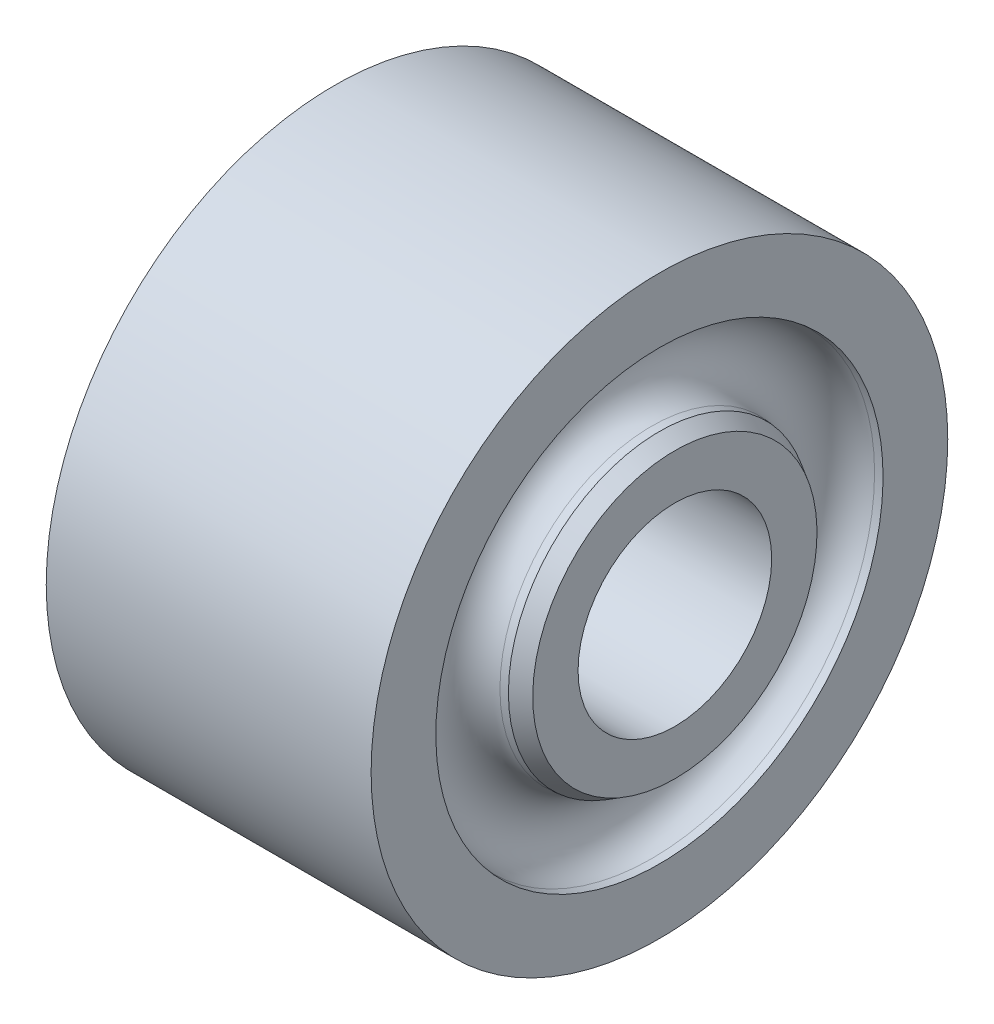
ISO-10303-21;
HEADER;
FILE_DESCRIPTION(('STEP AP214'),'2;1');
FILE_NAME('part.step','',(''),(''),'','','');
FILE_SCHEMA(('AUTOMOTIVE_DESIGN { 1 0 10303 214 1 1 1 1 }'));
ENDSEC;
DATA;
#1=APPLICATION_CONTEXT('core data for automotive mechanical design processes');
#2=APPLICATION_PROTOCOL_DEFINITION('international standard','automotive_design',2000,#1);
#3=PRODUCT_CONTEXT('',#1,'mechanical');
#4=PRODUCT('Part','Part','',(#3));
#5=PRODUCT_RELATED_PRODUCT_CATEGORY('part','',(#4));
#6=PRODUCT_DEFINITION_FORMATION('','',#4);
#7=PRODUCT_DEFINITION_CONTEXT('part definition',#1,'design');
#8=PRODUCT_DEFINITION('design','',#6,#7);
#9=PRODUCT_DEFINITION_SHAPE('','',#8);
#10=(LENGTH_UNIT() NAMED_UNIT(*) SI_UNIT(.MILLI.,.METRE.));
#11=(NAMED_UNIT(*) PLANE_ANGLE_UNIT() SI_UNIT($,.RADIAN.));
#12=(NAMED_UNIT(*) SI_UNIT($,.STERADIAN.) SOLID_ANGLE_UNIT());
#13=UNCERTAINTY_MEASURE_WITH_UNIT(LENGTH_MEASURE(1.E-05),#10,'distance_accuracy_value','');
#14=(GEOMETRIC_REPRESENTATION_CONTEXT(3) GLOBAL_UNCERTAINTY_ASSIGNED_CONTEXT((#13)) GLOBAL_UNIT_ASSIGNED_CONTEXT((#10,
#11,#12)) REPRESENTATION_CONTEXT('',''));
#15=CARTESIAN_POINT('',(0.,0.,0.));
#16=DIRECTION('',(0.,0.,1.));
#17=DIRECTION('',(1.,0.,0.));
#18=AXIS2_PLACEMENT_3D('',#15,#16,#17);
#19=CARTESIAN_POINT('',(-76.6240063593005,0.,0.));
#20=DIRECTION('',(-1.,0.,0.));
#21=DIRECTION('',(0.,0.,1.));
#22=AXIS2_PLACEMENT_3D('',#19,#20,#21);
#23=CYLINDRICAL_SURFACE('',#22,15.1384);
#24=CARTESIAN_POINT('',(-27.813,0.,0.));
#25=DIRECTION('',(-1.,0.,0.));
#26=DIRECTION('',(0.,0.,1.));
#27=AXIS2_PLACEMENT_3D('',#24,#25,#26);
#28=CIRCLE('',#27,15.1384);
#29=CARTESIAN_POINT('',(-27.813,0.,15.1384));
#30=VERTEX_POINT('',#29);
#31=EDGE_CURVE('E46',#30,#30,#28,.T.);
#32=ORIENTED_EDGE('',*,*,#31,.T.);
#33=EDGE_LOOP('',(#32));
#34=FACE_BOUND('',#33,.T.);
#35=CARTESIAN_POINT('',(27.813,0.,0.));
#36=DIRECTION('',(-1.,0.,0.));
#37=DIRECTION('',(0.,0.,1.));
#38=AXIS2_PLACEMENT_3D('',#35,#36,#37);
#39=CIRCLE('',#38,15.1384);
#40=CARTESIAN_POINT('',(27.813,0.,15.1384));
#41=VERTEX_POINT('',#40);
#42=EDGE_CURVE('E17',#41,#41,#39,.F.);
#43=ORIENTED_EDGE('',*,*,#42,.T.);
#44=EDGE_LOOP('',(#43));
#45=FACE_BOUND('',#44,.T.);
#46=ADVANCED_FACE('F14',(#34,#45),#23,.F.);
#47=CARTESIAN_POINT('',(27.813,15.1384,0.));
#48=DIRECTION('',(-1.,0.,0.));
#49=DIRECTION('',(0.,0.,1.));
#50=AXIS2_PLACEMENT_3D('',#47,#48,#49);
#51=PLANE('',#50);
#52=ORIENTED_EDGE('',*,*,#42,.F.);
#53=EDGE_LOOP('',(#52));
#54=FACE_BOUND('',#53,.T.);
#55=CARTESIAN_POINT('',(27.8130000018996,0.,0.));
#56=DIRECTION('',(-1.,0.,0.));
#57=DIRECTION('',(0.,-1.,0.));
#58=AXIS2_PLACEMENT_3D('',#55,#56,#57);
#59=CIRCLE('',#58,22.2250000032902);
#60=CARTESIAN_POINT('',(27.8130000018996,-22.2250000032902,0.));
#61=VERTEX_POINT('',#60);
#62=EDGE_CURVE('E44',#61,#61,#59,.T.);
#63=ORIENTED_EDGE('',*,*,#62,.F.);
#64=EDGE_LOOP('',(#63));
#65=FACE_BOUND('',#64,.T.);
#66=ADVANCED_FACE('F54',(#54,#65),#51,.F.);
#67=CARTESIAN_POINT('',(-27.813,22.225,0.));
#68=DIRECTION('',(1.,0.,0.));
#69=DIRECTION('',(0.,0.,-1.));
#70=AXIS2_PLACEMENT_3D('',#67,#68,#69);
#71=PLANE('',#70);
#72=ORIENTED_EDGE('',*,*,#31,.F.);
#73=EDGE_LOOP('',(#72));
#74=FACE_BOUND('',#73,.T.);
#75=CARTESIAN_POINT('',(-27.8130000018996,0.,0.));
#76=DIRECTION('',(1.,0.,0.));
#77=DIRECTION('',(0.,0.,-1.));
#78=AXIS2_PLACEMENT_3D('',#75,#76,#77);
#79=CIRCLE('',#78,22.2250000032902);
#80=CARTESIAN_POINT('',(-27.8130000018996,0.,-22.2250000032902));
#81=VERTEX_POINT('',#80);
#82=EDGE_CURVE('E40',#81,#81,#79,.T.);
#83=ORIENTED_EDGE('',*,*,#82,.F.);
#84=EDGE_LOOP('',(#83));
#85=FACE_BOUND('',#84,.T.);
#86=ADVANCED_FACE('F57',(#74,#85),#71,.F.);
#87=CARTESIAN_POINT('',(25.4000000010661,0.,0.));
#88=DIRECTION('',(-1.,0.,0.));
#89=DIRECTION('',(0.,-1.,0.));
#90=AXIS2_PLACEMENT_3D('',#87,#88,#89);
#91=CONICAL_SURFACE('',#90,23.6181462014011,0.523598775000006);
#92=CARTESIAN_POINT('',(25.4000000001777,0.,0.));
#93=DIRECTION('',(-1.,0.,0.));
#94=DIRECTION('',(0.,0.,1.));
#95=AXIS2_PLACEMENT_3D('',#92,#93,#94);
#96=CIRCLE('',#95,23.6181462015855);
#97=CARTESIAN_POINT('',(25.4000000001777,0.,23.6181462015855));
#98=VERTEX_POINT('',#97);
#99=EDGE_CURVE('E43',#98,#98,#96,.T.);
#100=ORIENTED_EDGE('',*,*,#99,.F.);
#101=EDGE_LOOP('',(#100));
#102=FACE_BOUND('',#101,.T.);
#103=ORIENTED_EDGE('',*,*,#62,.T.);
#104=EDGE_LOOP('',(#103));
#105=FACE_BOUND('',#104,.T.);
#106=ADVANCED_FACE('F60',(#102,#105),#91,.T.);
#107=CARTESIAN_POINT('',(-25.4000000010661,0.,0.));
#108=DIRECTION('',(1.,0.,0.));
#109=DIRECTION('',(0.,0.,-1.));
#110=AXIS2_PLACEMENT_3D('',#107,#108,#109);
#111=CONICAL_SURFACE('',#110,23.6181462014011,0.523598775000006);
#112=CARTESIAN_POINT('',(-25.4000000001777,0.,0.));
#113=DIRECTION('',(1.,0.,0.));
#114=DIRECTION('',(0.,0.,-1.));
#115=AXIS2_PLACEMENT_3D('',#112,#113,#114);
#116=CIRCLE('',#115,23.6181462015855);
#117=CARTESIAN_POINT('',(-25.4000000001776,0.,-23.6181462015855));
#118=VERTEX_POINT('',#117);
#119=EDGE_CURVE('E122',#118,#118,#116,.T.);
#120=ORIENTED_EDGE('',*,*,#119,.F.);
#121=EDGE_LOOP('',(#120));
#122=FACE_BOUND('',#121,.T.);
#123=ORIENTED_EDGE('',*,*,#82,.T.);
#124=EDGE_LOOP('',(#123));
#125=FACE_BOUND('',#124,.T.);
#126=ADVANCED_FACE('F62',(#122,#125),#111,.T.);
#127=CARTESIAN_POINT('',(24.1827237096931,0.,0.));
#128=DIRECTION('',(-1.,0.,0.));
#129=DIRECTION('',(0.,-1.,0.));
#130=AXIS2_PLACEMENT_3D('',#127,#128,#129);
#131=CONICAL_SURFACE('',#130,23.7246440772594,0.0872664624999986);
#132=CARTESIAN_POINT('',(24.1827237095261,0.,0.));
#133=DIRECTION('',(-1.,0.,0.));
#134=DIRECTION('',(0.,0.,1.));
#135=AXIS2_PLACEMENT_3D('',#132,#133,#134);
#136=CIRCLE('',#135,23.7246440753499);
#137=CARTESIAN_POINT('',(24.1827237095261,0.,23.7246440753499));
#138=VERTEX_POINT('',#137);
#139=EDGE_CURVE('E116',#138,#138,#136,.F.);
#140=ORIENTED_EDGE('',*,*,#139,.T.);
#141=EDGE_LOOP('',(#140));
#142=FACE_BOUND('',#141,.T.);
#143=ORIENTED_EDGE('',*,*,#99,.T.);
#144=EDGE_LOOP('',(#143));
#145=FACE_BOUND('',#144,.T.);
#146=ADVANCED_FACE('F70',(#142,#145),#131,.T.);
#147=CARTESIAN_POINT('',(-24.1827237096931,0.,0.));
#148=DIRECTION('',(1.,0.,0.));
#149=DIRECTION('',(0.,0.,-1.));
#150=AXIS2_PLACEMENT_3D('',#147,#148,#149);
#151=CONICAL_SURFACE('',#150,23.7246440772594,0.0872664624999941);
#152=CARTESIAN_POINT('',(-24.1827237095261,0.,0.));
#153=DIRECTION('',(-1.,0.,0.));
#154=DIRECTION('',(0.,0.,1.));
#155=AXIS2_PLACEMENT_3D('',#152,#153,#154);
#156=CIRCLE('',#155,23.7246440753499);
#157=CARTESIAN_POINT('',(-24.1827237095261,0.,23.7246440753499));
#158=VERTEX_POINT('',#157);
#159=EDGE_CURVE('E112',#158,#158,#156,.T.);
#160=ORIENTED_EDGE('',*,*,#159,.T.);
#161=EDGE_LOOP('',(#160));
#162=FACE_BOUND('',#161,.T.);
#163=ORIENTED_EDGE('',*,*,#119,.T.);
#164=EDGE_LOOP('',(#163));
#165=FACE_BOUND('',#164,.T.);
#166=ADVANCED_FACE('F131',(#162,#165),#151,.T.);
#167=CARTESIAN_POINT('',(24.66975,0.,0.));
#168=DIRECTION('',(-1.,0.,0.));
#169=DIRECTION('',(0.,0.,1.));
#170=AXIS2_PLACEMENT_3D('',#167,#168,#169);
#171=TOROIDAL_SURFACE('',#170,29.2913800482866,5.588);
#172=ORIENTED_EDGE('',*,*,#139,.F.);
#173=EDGE_LOOP('',(#172));
#174=FACE_BOUND('',#173,.T.);
#175=CARTESIAN_POINT('',(24.1827237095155,0.,0.));
#176=DIRECTION('',(1.,0.,0.));
#177=DIRECTION('',(0.,0.,-1.));
#178=AXIS2_PLACEMENT_3D('',#175,#176,#177);
#179=CIRCLE('',#178,34.8581160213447);
#180=CARTESIAN_POINT('',(24.1827237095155,0.,-34.8581160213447));
#181=VERTEX_POINT('',#180);
#182=EDGE_CURVE('E115',#181,#181,#179,.T.);
#183=ORIENTED_EDGE('',*,*,#182,.T.);
#184=EDGE_LOOP('',(#183));
#185=FACE_BOUND('',#184,.T.);
#186=ADVANCED_FACE('F103',(#174,#185),#171,.F.);
#187=CARTESIAN_POINT('',(-24.66975,0.,0.));
#188=DIRECTION('',(-1.,0.,0.));
#189=DIRECTION('',(0.,0.,1.));
#190=AXIS2_PLACEMENT_3D('',#187,#188,#189);
#191=TOROIDAL_SURFACE('',#190,29.2913800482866,5.588);
#192=CARTESIAN_POINT('',(-24.1827237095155,0.,0.));
#193=DIRECTION('',(-1.,0.,0.));
#194=DIRECTION('',(0.,0.,1.));
#195=AXIS2_PLACEMENT_3D('',#192,#193,#194);
#196=CIRCLE('',#195,34.8581160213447);
#197=CARTESIAN_POINT('',(-24.1827237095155,0.,34.8581160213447));
#198=VERTEX_POINT('',#197);
#199=EDGE_CURVE('E39',#198,#198,#196,.T.);
#200=ORIENTED_EDGE('',*,*,#199,.T.);
#201=EDGE_LOOP('',(#200));
#202=FACE_BOUND('',#201,.T.);
#203=ORIENTED_EDGE('',*,*,#159,.F.);
#204=EDGE_LOOP('',(#203));
#205=FACE_BOUND('',#204,.T.);
#206=ADVANCED_FACE('F98',(#202,#205),#191,.F.);
#207=CARTESIAN_POINT('',(25.4,0.,0.));
#208=DIRECTION('',(1.,0.,0.));
#209=DIRECTION('',(0.,1.,0.));
#210=AXIS2_PLACEMENT_3D('',#207,#208,#209);
#211=CONICAL_SURFACE('',#210,34.9646138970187,0.087266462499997);
#212=CARTESIAN_POINT('',(25.4,0.,0.));
#213=DIRECTION('',(1.,0.,0.));
#214=DIRECTION('',(0.,1.,0.));
#215=AXIS2_PLACEMENT_3D('',#212,#213,#214);
#216=CIRCLE('',#215,34.9646138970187);
#217=CARTESIAN_POINT('',(25.4,34.9646138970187,0.));
#218=VERTEX_POINT('',#217);
#219=EDGE_CURVE('E35',#218,#218,#216,.T.);
#220=ORIENTED_EDGE('',*,*,#219,.T.);
#221=EDGE_LOOP('',(#220));
#222=FACE_BOUND('',#221,.T.);
#223=ORIENTED_EDGE('',*,*,#182,.F.);
#224=EDGE_LOOP('',(#223));
#225=FACE_BOUND('',#224,.T.);
#226=ADVANCED_FACE('F94',(#222,#225),#211,.F.);
#227=CARTESIAN_POINT('',(-25.4,0.,0.));
#228=DIRECTION('',(-1.,0.,0.));
#229=DIRECTION('',(0.,0.,1.));
#230=AXIS2_PLACEMENT_3D('',#227,#228,#229);
#231=CONICAL_SURFACE('',#230,34.9646138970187,0.087266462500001);
#232=CARTESIAN_POINT('',(-25.4,0.,0.));
#233=DIRECTION('',(-1.,0.,0.));
#234=DIRECTION('',(0.,0.,1.));
#235=AXIS2_PLACEMENT_3D('',#232,#233,#234);
#236=CIRCLE('',#235,34.9646138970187);
#237=CARTESIAN_POINT('',(-25.4,0.,34.9646138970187));
#238=VERTEX_POINT('',#237);
#239=EDGE_CURVE('E27',#238,#238,#236,.T.);
#240=ORIENTED_EDGE('',*,*,#239,.T.);
#241=EDGE_LOOP('',(#240));
#242=FACE_BOUND('',#241,.T.);
#243=ORIENTED_EDGE('',*,*,#199,.F.);
#244=EDGE_LOOP('',(#243));
#245=FACE_BOUND('',#244,.T.);
#246=ADVANCED_FACE('F90',(#242,#245),#231,.F.);
#247=CARTESIAN_POINT('',(25.4,23.6181461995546,0.));
#248=DIRECTION('',(-1.,0.,0.));
#249=DIRECTION('',(0.,0.,1.));
#250=AXIS2_PLACEMENT_3D('',#247,#248,#249);
#251=PLANE('',#250);
#252=ORIENTED_EDGE('',*,*,#219,.F.);
#253=EDGE_LOOP('',(#252));
#254=FACE_BOUND('',#253,.T.);
#255=CARTESIAN_POINT('',(25.4,0.,0.));
#256=DIRECTION('',(-1.,0.,0.));
#257=DIRECTION('',(0.,0.,1.));
#258=AXIS2_PLACEMENT_3D('',#255,#256,#257);
#259=CIRCLE('',#258,45.085);
#260=CARTESIAN_POINT('',(25.4,0.,45.085));
#261=VERTEX_POINT('',#260);
#262=EDGE_CURVE('E21',#261,#261,#259,.T.);
#263=ORIENTED_EDGE('',*,*,#262,.F.);
#264=EDGE_LOOP('',(#263));
#265=FACE_BOUND('',#264,.T.);
#266=ADVANCED_FACE('F84',(#254,#265),#251,.F.);
#267=CARTESIAN_POINT('',(-25.4,45.085,0.));
#268=DIRECTION('',(1.,0.,0.));
#269=DIRECTION('',(0.,0.,-1.));
#270=AXIS2_PLACEMENT_3D('',#267,#268,#269);
#271=PLANE('',#270);
#272=ORIENTED_EDGE('',*,*,#239,.F.);
#273=EDGE_LOOP('',(#272));
#274=FACE_BOUND('',#273,.T.);
#275=CARTESIAN_POINT('',(-25.4,0.,0.));
#276=DIRECTION('',(-1.,0.,0.));
#277=DIRECTION('',(0.,0.,1.));
#278=AXIS2_PLACEMENT_3D('',#275,#276,#277);
#279=CIRCLE('',#278,45.085);
#280=CARTESIAN_POINT('',(-25.4,0.,45.085));
#281=VERTEX_POINT('',#280);
#282=EDGE_CURVE('E10',#281,#281,#279,.F.);
#283=ORIENTED_EDGE('',*,*,#282,.F.);
#284=EDGE_LOOP('',(#283));
#285=FACE_BOUND('',#284,.T.);
#286=ADVANCED_FACE('F78',(#274,#285),#271,.F.);
#287=CARTESIAN_POINT('',(-76.6240063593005,0.,0.));
#288=DIRECTION('',(-1.,0.,0.));
#289=DIRECTION('',(0.,0.,1.));
#290=AXIS2_PLACEMENT_3D('',#287,#288,#289);
#291=CYLINDRICAL_SURFACE('',#290,45.085);
#292=ORIENTED_EDGE('',*,*,#282,.T.);
#293=EDGE_LOOP('',(#292));
#294=FACE_BOUND('',#293,.T.);
#295=ORIENTED_EDGE('',*,*,#262,.T.);
#296=EDGE_LOOP('',(#295));
#297=FACE_BOUND('',#296,.T.);
#298=ADVANCED_FACE('F76',(#294,#297),#291,.T.);
#299=CLOSED_SHELL('',(#46,#66,#86,#106,#126,#146,#166,#186,#206,#226,#246,#266,#286,#298));
#300=MANIFOLD_SOLID_BREP('B1',#299);
#301=ADVANCED_BREP_SHAPE_REPRESENTATION('',(#18,#300),#14);
#302=SHAPE_DEFINITION_REPRESENTATION(#9,#301);
ENDSEC;
END-ISO-10303-21;
